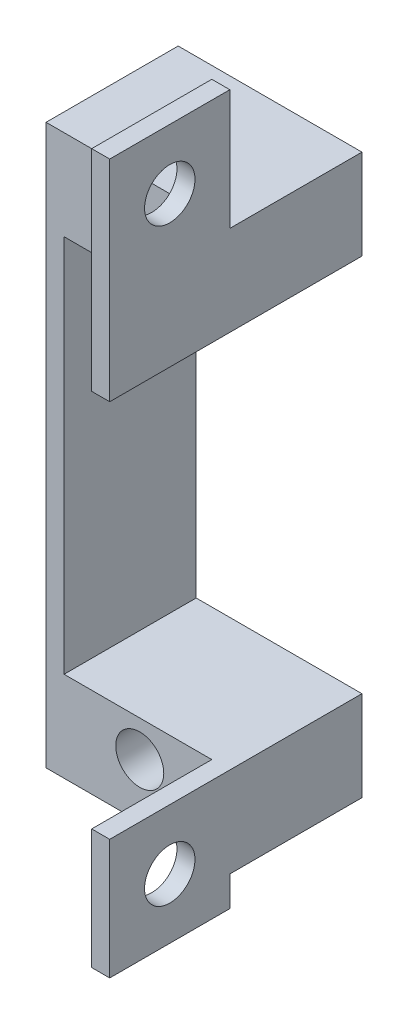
from build123d import *

# Parameters (mm, degrees)
SKETCH17_W           = 15.3
SKETCH17_H           = 7.5
BOSS_EXTRUDE12_DEPTH = 11
SKETCH18_W           = 1.5
SKETCH18_H           = 11
BOSS_EXTRUDE13_DEPTH = 15.775
SKETCH19_R           = 2
CUT_EXTRUDE2_DEPTH   = 51.816748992
SKETCH21_W           = 1.5
SKETCH21_H           = 7.5
BOSS_EXTRUDE14_DEPTH = 10
SKETCH22_W           = 1.5
SKETCH22_H           = 10
BOSS_EXTRUDE15_DEPTH = 10
SKETCH23_R           = 2.1
CUT_EXTRUDE4_DEPTH   = 10
SKETCH25_W           = 1.5
SKETCH25_H           = 11
BOSS_EXTRUDE16_DEPTH = 23.275
SKETCH26_W           = 11
SKETCH26_H           = 7.5
BOSS_EXTRUDE17_DEPTH = 13.8
SKETCH27_W           = 1.5
SKETCH27_H           = 7.5
BOSS_EXTRUDE18_DEPTH = 10
SKETCH28_W           = 1.5
SKETCH28_H           = 10
BOSS_EXTRUDE19_DEPTH = 2.5
SKETCH29_R           = 2.1
CUT_EXTRUDE5_DEPTH   = 59.585904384


with BuildPart() as part:
    # Sketch17 → Boss-Extrude12 (new body)
    with BuildSketch(Plane.XY):
        with Locations((-17.228472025, 39.173229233)):
            Rectangle(SKETCH17_W, SKETCH17_H)
    extrude(amount=BOSS_EXTRUDE12_DEPTH)

    # Sketch18 → Boss-Extrude13 (add)
    with BuildSketch(Plane.XZ.offset(-35.423229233)):
        with Locations((-24.128472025, 5.5)):
            Rectangle(SKETCH18_W, SKETCH18_H)
    extrude(amount=BOSS_EXTRUDE13_DEPTH)

    # Sketch19 → Cut-Extrude2 (cut, through all)
    with BuildSketch(Plane.XY.offset(11)):
        with Locations((-17.078472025, 38.423229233)):
            Circle(SKETCH19_R)
    cut_extrude2 = extrude(amount=-CUT_EXTRUDE2_DEPTH, mode=Mode.SUBTRACT)

    # Sketch21 → Boss-Extrude14 (add)
    with BuildSketch(Plane.XY.offset(11)):
        with Locations((-10.328472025, 39.173229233)):
            Rectangle(SKETCH21_W, SKETCH21_H)
    extrude(amount=BOSS_EXTRUDE14_DEPTH)

    # Sketch22 → Boss-Extrude15 (add)
    with BuildSketch(Plane(origin=(0, 42.923229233, 0), x_dir=(1, 0, 0), z_dir=(0, 1, 0))):
        with Locations((-10.328472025, -16)):
            Rectangle(SKETCH22_W, SKETCH22_H)
    extrude(amount=BOSS_EXTRUDE15_DEPTH)

    # Sketch23 → Cut-Extrude4 (cut)
    with BuildSketch(Plane.ZY.offset(11.078472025)):
        with Locations(Location((16, 47.923229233, 0), (0, 0, 270))):
            Circle(SKETCH23_R)
    extrude(amount=-CUT_EXTRUDE4_DEPTH, mode=Mode.SUBTRACT)

    # Sketch25 → Boss-Extrude16 (add)
    with BuildSketch(Plane.XZ.offset(-19.648229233)):
        with Locations((-24.128472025, 5.5)):
            Rectangle(SKETCH25_W, SKETCH25_H)
    extrude(amount=BOSS_EXTRUDE16_DEPTH)

    # Sketch26 → Boss-Extrude17 (add)
    with BuildSketch(Plane(origin=(-23.378472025, 0, 0), x_dir=(0, 0, -1), z_dir=(1, 0, 0))):
        with Locations((-5.5, 0.123229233)):
            Rectangle(SKETCH26_W, SKETCH26_H)
    extrude(amount=BOSS_EXTRUDE17_DEPTH)

    # Mirror12: Cut-Extrude2 across plane
    add(cut_extrude2.mirror(Plane(origin=(0, 19.648229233, 0), x_dir=(0, 0, 1), z_dir=(0, -1, 0))), mode=Mode.SUBTRACT)

    # Sketch27 → Boss-Extrude18 (add)
    with BuildSketch(Plane.XY.offset(11)):
        with Locations((-10.328472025, 0.123229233)):
            Rectangle(SKETCH27_W, SKETCH27_H)
    extrude(amount=BOSS_EXTRUDE18_DEPTH)

    # Sketch28 → Boss-Extrude19 (add)
    with BuildSketch(Plane.XZ.offset(3.626770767)):
        with Locations((-10.328472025, 16)):
            Rectangle(SKETCH28_W, SKETCH28_H)
    extrude(amount=BOSS_EXTRUDE19_DEPTH)

    # Sketch29 → Cut-Extrude5 (cut, through all)
    with BuildSketch(Plane.ZY.offset(11.078472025)):
        with Locations((16, -1.126770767)):
            Circle(SKETCH29_R)
    extrude(amount=-CUT_EXTRUDE5_DEPTH, mode=Mode.SUBTRACT)


solid = part.part
